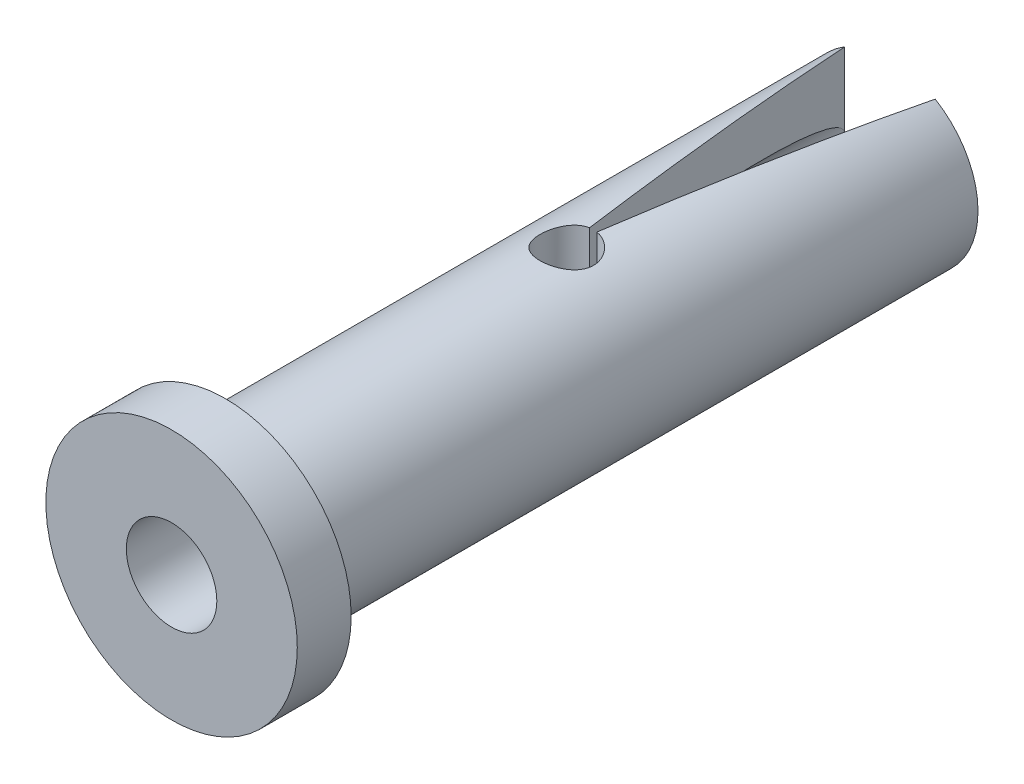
ISO-10303-21;
HEADER;
FILE_DESCRIPTION(('STEP AP214'),'2;1');
FILE_NAME('part.step','',(''),(''),'','','');
FILE_SCHEMA(('AUTOMOTIVE_DESIGN { 1 0 10303 214 1 1 1 1 }'));
ENDSEC;
DATA;
#1=APPLICATION_CONTEXT('core data for automotive mechanical design processes');
#2=APPLICATION_PROTOCOL_DEFINITION('international standard','automotive_design',2000,#1);
#3=PRODUCT_CONTEXT('',#1,'mechanical');
#4=PRODUCT('Part','Part','',(#3));
#5=PRODUCT_RELATED_PRODUCT_CATEGORY('part','',(#4));
#6=PRODUCT_DEFINITION_FORMATION('','',#4);
#7=PRODUCT_DEFINITION_CONTEXT('part definition',#1,'design');
#8=PRODUCT_DEFINITION('design','',#6,#7);
#9=PRODUCT_DEFINITION_SHAPE('','',#8);
#10=(LENGTH_UNIT() NAMED_UNIT(*) SI_UNIT(.MILLI.,.METRE.));
#11=(NAMED_UNIT(*) PLANE_ANGLE_UNIT() SI_UNIT($,.RADIAN.));
#12=(NAMED_UNIT(*) SI_UNIT($,.STERADIAN.) SOLID_ANGLE_UNIT());
#13=UNCERTAINTY_MEASURE_WITH_UNIT(LENGTH_MEASURE(1.E-05),#10,'distance_accuracy_value','');
#14=(GEOMETRIC_REPRESENTATION_CONTEXT(3) GLOBAL_UNCERTAINTY_ASSIGNED_CONTEXT((#13)) GLOBAL_UNIT_ASSIGNED_CONTEXT((#10,
#11,#12)) REPRESENTATION_CONTEXT('',''));
#15=CARTESIAN_POINT('',(0.,0.,0.));
#16=DIRECTION('',(0.,0.,1.));
#17=DIRECTION('',(1.,0.,0.));
#18=AXIS2_PLACEMENT_3D('',#15,#16,#17);
#19=CARTESIAN_POINT('',(0.,0.,20.));
#20=DIRECTION('',(0.,0.,-1.));
#21=DIRECTION('',(-1.,0.,0.));
#22=AXIS2_PLACEMENT_3D('',#19,#20,#21);
#23=CYLINDRICAL_SURFACE('',#22,1.26);
#24=CARTESIAN_POINT('',(0.,0.,8.18632314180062));
#25=DIRECTION('',(0.,0.,1.));
#26=DIRECTION('',(1.,0.,0.));
#27=AXIS2_PLACEMENT_3D('',#24,#25,#26);
#28=CIRCLE('',#27,1.26);
#29=CARTESIAN_POINT('',(-0.113914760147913,-1.25484000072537,8.18632314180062));
#30=VERTEX_POINT('',#29);
#31=CARTESIAN_POINT('',(-0.113914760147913,1.25484000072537,8.18632314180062));
#32=VERTEX_POINT('',#31);
#33=EDGE_CURVE('E236',#30,#32,#28,.F.);
#34=ORIENTED_EDGE('',*,*,#33,.F.);
#35=CARTESIAN_POINT('',(0.,0.,9.));
#36=DIRECTION('',(0.99034174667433,0.,-0.138647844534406));
#37=DIRECTION('',(-0.138647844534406,0.,-0.99034174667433));
#38=AXIS2_PLACEMENT_3D('',#35,#36,#37);
#39=ELLIPSE('',#38,9.08777200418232,1.26);
#40=CARTESIAN_POINT('',(-1.26,0.,0.));
#41=VERTEX_POINT('',#40);
#42=EDGE_CURVE('E57',#30,#41,#39,.T.);
#43=ORIENTED_EDGE('',*,*,#42,.T.);
#44=EDGE_CURVE('E228',#41,#32,#39,.T.);
#45=ORIENTED_EDGE('',*,*,#44,.T.);
#46=EDGE_LOOP('',(#34,#43,#45));
#47=FACE_BOUND('',#46,.T.);
#48=ADVANCED_FACE('F35',(#47),#23,.F.);
#49=CARTESIAN_POINT('',(0.113914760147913,1.25484000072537,8.18632314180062));
#50=VERTEX_POINT('',#49);
#51=CARTESIAN_POINT('',(0.113914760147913,-1.25484000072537,8.18632314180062));
#52=VERTEX_POINT('',#51);
#53=EDGE_CURVE('E315',#50,#52,#28,.F.);
#54=ORIENTED_EDGE('',*,*,#53,.F.);
#55=CARTESIAN_POINT('',(0.,0.,9.));
#56=DIRECTION('',(-0.99034174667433,0.,-0.138647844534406));
#57=DIRECTION('',(0.138647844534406,0.,-0.99034174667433));
#58=AXIS2_PLACEMENT_3D('',#55,#56,#57);
#59=ELLIPSE('',#58,9.08777200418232,1.26);
#60=CARTESIAN_POINT('',(1.26,0.,0.));
#61=VERTEX_POINT('',#60);
#62=EDGE_CURVE('E229',#50,#61,#59,.T.);
#63=ORIENTED_EDGE('',*,*,#62,.T.);
#64=EDGE_CURVE('E230',#61,#52,#59,.T.);
#65=ORIENTED_EDGE('',*,*,#64,.T.);
#66=EDGE_LOOP('',(#54,#63,#65));
#67=FACE_BOUND('',#66,.T.);
#68=ADVANCED_FACE('F268',(#67),#23,.F.);
#69=CARTESIAN_POINT('',(0.,0.,20.));
#70=DIRECTION('',(0.,0.,-1.));
#71=DIRECTION('',(-1.,0.,0.));
#72=AXIS2_PLACEMENT_3D('',#69,#70,#71);
#73=CYLINDRICAL_SURFACE('',#72,2.45);
#74=CARTESIAN_POINT('',(0.,0.,18.5));
#75=DIRECTION('',(0.,0.,1.));
#76=DIRECTION('',(1.,0.,0.));
#77=AXIS2_PLACEMENT_3D('',#74,#75,#76);
#78=CIRCLE('',#77,2.45);
#79=CARTESIAN_POINT('',(2.45,0.,18.5));
#80=VERTEX_POINT('',#79);
#81=EDGE_CURVE('E225',#80,#80,#78,.T.);
#82=ORIENTED_EDGE('',*,*,#81,.F.);
#83=EDGE_LOOP('',(#82));
#84=FACE_BOUND('',#83,.T.);
#85=CARTESIAN_POINT('',(0.,0.,9.));
#86=DIRECTION('',(0.99034174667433,0.,-0.138647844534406));
#87=DIRECTION('',(-0.138647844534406,0.,-0.99034174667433));
#88=AXIS2_PLACEMENT_3D('',#85,#86,#87);
#89=ELLIPSE('',#88,17.6706677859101,2.45);
#90=CARTESIAN_POINT('',(-0.103378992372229,-2.44781796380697,8.26157862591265));
#91=VERTEX_POINT('',#90);
#92=CARTESIAN_POINT('',(-1.26,-2.10116634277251,0.));
#93=VERTEX_POINT('',#92);
#94=EDGE_CURVE('E206',#91,#93,#89,.T.);
#95=ORIENTED_EDGE('',*,*,#94,.F.);
#96=CARTESIAN_POINT('',(0.,-2.45,9.74562278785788));
#97=CARTESIAN_POINT('',(-0.0408766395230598,-2.44999969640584,9.74562236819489));
#98=CARTESIAN_POINT('',(-0.0817575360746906,-2.44896726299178,9.74225024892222));
#99=CARTESIAN_POINT('',(-0.162327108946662,-2.44494964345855,9.7288840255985));
#100=CARTESIAN_POINT('',(-0.202015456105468,-2.44196392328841,9.71888811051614));
#101=CARTESIAN_POINT('',(-0.279026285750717,-2.43436654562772,9.69264021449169));
#102=CARTESIAN_POINT('',(-0.316352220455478,-2.42975732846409,9.67639761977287));
#103=CARTESIAN_POINT('',(-0.387750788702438,-2.41939094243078,9.63815641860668));
#104=CARTESIAN_POINT('',(-0.421822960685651,-2.41363361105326,9.61615699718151));
#105=CARTESIAN_POINT('',(-0.4867505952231,-2.40139441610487,9.5663439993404));
#106=CARTESIAN_POINT('',(-0.517496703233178,-2.3948973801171,9.53839162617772));
#107=CARTESIAN_POINT('',(-0.57394516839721,-2.38200063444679,9.47776190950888));
#108=CARTESIAN_POINT('',(-0.599646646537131,-2.37560094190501,9.44508374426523));
#109=CARTESIAN_POINT('',(-0.645857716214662,-2.36346217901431,9.37499744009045));
#110=CARTESIAN_POINT('',(-0.666232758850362,-2.35774191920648,9.33749702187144));
#111=CARTESIAN_POINT('',(-0.700342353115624,-2.34783694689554,9.25939981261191));
#112=CARTESIAN_POINT('',(-0.714078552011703,-2.34365185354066,9.21880379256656));
#113=CARTESIAN_POINT('',(-0.734124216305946,-2.33744938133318,9.13689780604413));
#114=CARTESIAN_POINT('',(-0.740635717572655,-2.33537317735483,9.09564186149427));
#115=CARTESIAN_POINT('',(-0.746678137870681,-2.33344867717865,9.01257487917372));
#116=CARTESIAN_POINT('',(-0.746210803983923,-2.33359982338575,8.9707639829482));
#117=CARTESIAN_POINT('',(-0.738467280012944,-2.33606088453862,8.88942653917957));
#118=CARTESIAN_POINT('',(-0.731445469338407,-2.33829014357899,8.84987292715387));
#119=CARTESIAN_POINT('',(-0.711203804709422,-2.3445255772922,8.77253411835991));
#120=CARTESIAN_POINT('',(-0.697983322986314,-2.34853193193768,8.73474910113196));
#121=CARTESIAN_POINT('',(-0.66553488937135,-2.35793363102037,8.66140342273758));
#122=CARTESIAN_POINT('',(-0.646225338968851,-2.36334765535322,8.62588135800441));
#123=CARTESIAN_POINT('',(-0.602203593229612,-2.37494583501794,8.5584970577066));
#124=CARTESIAN_POINT('',(-0.577490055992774,-2.38113018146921,8.52663573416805));
#125=CARTESIAN_POINT('',(-0.522103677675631,-2.39389808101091,8.4660361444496));
#126=CARTESIAN_POINT('',(-0.491220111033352,-2.40048735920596,8.43749134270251));
#127=CARTESIAN_POINT('',(-0.425022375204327,-2.4130871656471,8.38594031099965));
#128=CARTESIAN_POINT('',(-0.38970791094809,-2.41909765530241,8.36293445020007));
#129=CARTESIAN_POINT('',(-0.315291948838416,-2.42992031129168,8.32299224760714));
#130=CARTESIAN_POINT('',(-0.276165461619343,-2.43472371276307,8.30609992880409));
#131=CARTESIAN_POINT('',(-0.195446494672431,-2.44252778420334,8.27919320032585));
#132=CARTESIAN_POINT('',(-0.153854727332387,-2.44552897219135,8.26917681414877));
#133=CARTESIAN_POINT('',(-0.0710296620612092,-2.44930804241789,8.25663092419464));
#134=CARTESIAN_POINT('',(-0.0298395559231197,-2.45016372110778,8.25383932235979));
#135=CARTESIAN_POINT('',(0.0524238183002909,-2.44978423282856,8.25508612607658));
#136=CARTESIAN_POINT('',(0.0934971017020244,-2.44854935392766,8.25912359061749));
#137=CARTESIAN_POINT('',(0.173364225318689,-2.4441784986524,8.27370249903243));
#138=CARTESIAN_POINT('',(0.212188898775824,-2.44108759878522,8.2840898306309));
#139=CARTESIAN_POINT('',(0.287535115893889,-2.43336374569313,8.31088729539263));
#140=CARTESIAN_POINT('',(0.324056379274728,-2.42873060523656,8.32729815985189));
#141=CARTESIAN_POINT('',(0.394715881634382,-2.41826508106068,8.36611058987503));
#142=CARTESIAN_POINT('',(0.428777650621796,-2.41240700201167,8.38864425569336));
#143=CARTESIAN_POINT('',(0.492725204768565,-2.40016325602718,8.4389028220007));
#144=CARTESIAN_POINT('',(0.522609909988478,-2.39377745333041,8.46662906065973));
#145=CARTESIAN_POINT('',(0.578515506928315,-2.38089782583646,8.52771768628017));
#146=CARTESIAN_POINT('',(0.604349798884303,-2.37440891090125,8.56125225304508));
#147=CARTESIAN_POINT('',(0.650038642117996,-2.36231037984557,8.63232167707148));
#148=CARTESIAN_POINT('',(0.669893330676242,-2.35670074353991,8.66985644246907));
#149=CARTESIAN_POINT('',(0.702927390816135,-2.34705980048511,8.74775479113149));
#150=CARTESIAN_POINT('',(0.716136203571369,-2.34302155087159,8.78810497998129));
#151=CARTESIAN_POINT('',(0.735529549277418,-2.33700692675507,8.87060348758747));
#152=CARTESIAN_POINT('',(0.741716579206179,-2.33502981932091,8.91275116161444));
#153=CARTESIAN_POINT('',(0.746717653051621,-2.33343498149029,8.99570558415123));
#154=CARTESIAN_POINT('',(0.745836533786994,-2.33371969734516,9.03649231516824));
#155=CARTESIAN_POINT('',(0.737456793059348,-2.33638104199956,9.11730714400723));
#156=CARTESIAN_POINT('',(0.729958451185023,-2.33875758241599,9.15733527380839));
#157=CARTESIAN_POINT('',(0.708756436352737,-2.3452684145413,9.23498233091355));
#158=CARTESIAN_POINT('',(0.695135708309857,-2.34937916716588,9.27262602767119));
#159=CARTESIAN_POINT('',(0.662140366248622,-2.35889033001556,9.34512394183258));
#160=CARTESIAN_POINT('',(0.642764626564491,-2.36429099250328,9.37997761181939));
#161=CARTESIAN_POINT('',(0.597961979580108,-2.37602525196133,9.44731499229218));
#162=CARTESIAN_POINT('',(0.572336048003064,-2.38238616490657,9.47966151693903));
#163=CARTESIAN_POINT('',(0.516115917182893,-2.39519400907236,9.53969400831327));
#164=CARTESIAN_POINT('',(0.485520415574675,-2.40164096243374,9.56737874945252));
#165=CARTESIAN_POINT('',(0.419110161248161,-2.41412942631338,9.6181415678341));
#166=CARTESIAN_POINT('',(0.383165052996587,-2.42015266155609,9.64105408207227));
#167=CARTESIAN_POINT('',(0.307749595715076,-2.43089227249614,9.68047923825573));
#168=CARTESIAN_POINT('',(0.268280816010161,-2.43560922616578,9.69699471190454));
#169=CARTESIAN_POINT('',(0.190992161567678,-2.44282131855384,9.72177220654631));
#170=CARTESIAN_POINT('',(0.153398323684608,-2.4454906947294,9.73069141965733));
#171=CARTESIAN_POINT('',(0.0772041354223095,-2.44908002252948,9.74261638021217));
#172=CARTESIAN_POINT('',(0.0386039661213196,-2.45000028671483,9.7456231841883));
#173=CARTESIAN_POINT('',(0.,-2.45,9.74562278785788));
#174=B_SPLINE_CURVE_WITH_KNOTS('',3,(#96,#97,#98,#99,#100,#101,#102,#103,#104,#105,#106,#107,
#108,#109,#110,#111,#112,#113,#114,#115,#116,#117,#118,#119,#120,#121,#122,#123,#124,#125,#126,
#127,#128,#129,#130,#131,#132,#133,#134,#135,#136,#137,#138,#139,#140,#141,#142,#143,#144,#145,
#146,#147,#148,#149,#150,#151,#152,#153,#154,#155,#156,#157,#158,#159,#160,#161,#162,#163,#164,
#165,#166,#167,#168,#169,#170,#171,#172,#173),.UNSPECIFIED.,.T.,.F.,(4,2,2,2,2,2,2,2,2,2,2,2,2,
2,2,2,2,2,2,2,2,2,2,2,2,2,2,2,2,2,2,2,2,2,2,2,2,2,4),(0.,0.122488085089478,0.245009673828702,
0.367347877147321,0.489703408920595,0.615305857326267,0.740930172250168,0.869474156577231,
0.997986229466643,1.12280607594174,1.24759467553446,1.36773305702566,1.48788360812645,
1.60971808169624,1.73158284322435,1.85869322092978,1.985812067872,2.11382888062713,
2.24180887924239,2.36507645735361,2.48832705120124,2.60869895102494,2.72908546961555,
2.85230987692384,2.97556608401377,3.1034379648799,3.23130690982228,3.35860429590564,
3.48585640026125,3.60765083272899,3.72944011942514,3.84962696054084,3.96983732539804,
4.09453866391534,4.21927273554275,4.34779743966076,4.47626518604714,4.59196381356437,
4.707641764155),.UNSPECIFIED.);
#175=CARTESIAN_POINT('',(0.103378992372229,-2.44781796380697,8.26157862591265));
#176=VERTEX_POINT('',#175);
#177=EDGE_CURVE('E255',#176,#91,#174,.T.);
#178=ORIENTED_EDGE('',*,*,#177,.F.);
#179=CARTESIAN_POINT('',(0.,0.,9.));
#180=DIRECTION('',(-0.99034174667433,0.,-0.138647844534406));
#181=DIRECTION('',(0.138647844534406,0.,-0.99034174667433));
#182=AXIS2_PLACEMENT_3D('',#179,#180,#181);
#183=ELLIPSE('',#182,17.6706677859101,2.45);
#184=CARTESIAN_POINT('',(1.26,-2.10116634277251,0.));
#185=VERTEX_POINT('',#184);
#186=EDGE_CURVE('E211',#185,#176,#183,.T.);
#187=ORIENTED_EDGE('',*,*,#186,.F.);
#188=CARTESIAN_POINT('',(0.,0.,0.));
#189=DIRECTION('',(0.,0.,1.));
#190=DIRECTION('',(1.,0.,0.));
#191=AXIS2_PLACEMENT_3D('',#188,#189,#190);
#192=CIRCLE('',#191,2.45);
#193=CARTESIAN_POINT('',(1.26,2.10116634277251,0.));
#194=VERTEX_POINT('',#193);
#195=EDGE_CURVE('E219',#185,#194,#192,.T.);
#196=ORIENTED_EDGE('',*,*,#195,.T.);
#197=CARTESIAN_POINT('',(0.103378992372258,2.44781796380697,8.26157862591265));
#198=VERTEX_POINT('',#197);
#199=EDGE_CURVE('E209',#198,#194,#183,.T.);
#200=ORIENTED_EDGE('',*,*,#199,.F.);
#201=CARTESIAN_POINT('',(0.,2.45,8.25437721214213));
#202=CARTESIAN_POINT('',(0.0408766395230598,2.44999969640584,8.25437763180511));
#203=CARTESIAN_POINT('',(0.0817575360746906,2.44896726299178,8.25774975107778));
#204=CARTESIAN_POINT('',(0.162327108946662,2.44494964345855,8.2711159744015));
#205=CARTESIAN_POINT('',(0.202015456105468,2.44196392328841,8.28111188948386));
#206=CARTESIAN_POINT('',(0.279026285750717,2.43436654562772,8.30735978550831));
#207=CARTESIAN_POINT('',(0.316352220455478,2.42975732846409,8.32360238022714));
#208=CARTESIAN_POINT('',(0.387750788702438,2.41939094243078,8.36184358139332));
#209=CARTESIAN_POINT('',(0.421822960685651,2.41363361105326,8.38384300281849));
#210=CARTESIAN_POINT('',(0.4867505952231,2.40139441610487,8.4336560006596));
#211=CARTESIAN_POINT('',(0.517496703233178,2.3948973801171,8.46160837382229));
#212=CARTESIAN_POINT('',(0.57394516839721,2.38200063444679,8.52223809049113));
#213=CARTESIAN_POINT('',(0.599646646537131,2.37560094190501,8.55491625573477));
#214=CARTESIAN_POINT('',(0.645857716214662,2.36346217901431,8.62500255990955));
#215=CARTESIAN_POINT('',(0.666232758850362,2.35774191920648,8.66250297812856));
#216=CARTESIAN_POINT('',(0.700342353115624,2.34783694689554,8.74060018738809));
#217=CARTESIAN_POINT('',(0.714078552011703,2.34365185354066,8.78119620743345));
#218=CARTESIAN_POINT('',(0.734124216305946,2.33744938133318,8.86310219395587));
#219=CARTESIAN_POINT('',(0.740635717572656,2.33537317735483,8.90435813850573));
#220=CARTESIAN_POINT('',(0.746678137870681,2.33344867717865,8.98742512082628));
#221=CARTESIAN_POINT('',(0.746210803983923,2.33359982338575,9.02923601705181));
#222=CARTESIAN_POINT('',(0.738467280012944,2.33606088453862,9.11057346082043));
#223=CARTESIAN_POINT('',(0.731445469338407,2.33829014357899,9.15012707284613));
#224=CARTESIAN_POINT('',(0.711203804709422,2.3445255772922,9.22746588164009));
#225=CARTESIAN_POINT('',(0.697983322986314,2.34853193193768,9.26525089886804));
#226=CARTESIAN_POINT('',(0.66553488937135,2.35793363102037,9.33859657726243));
#227=CARTESIAN_POINT('',(0.646225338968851,2.36334765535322,9.37411864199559));
#228=CARTESIAN_POINT('',(0.602203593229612,2.37494583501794,9.44150294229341));
#229=CARTESIAN_POINT('',(0.577490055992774,2.38113018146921,9.47336426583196));
#230=CARTESIAN_POINT('',(0.522103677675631,2.39389808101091,9.5339638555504));
#231=CARTESIAN_POINT('',(0.491220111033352,2.40048735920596,9.56250865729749));
#232=CARTESIAN_POINT('',(0.425022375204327,2.4130871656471,9.61405968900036));
#233=CARTESIAN_POINT('',(0.38970791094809,2.41909765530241,9.63706554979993));
#234=CARTESIAN_POINT('',(0.315291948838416,2.42992031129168,9.67700775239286));
#235=CARTESIAN_POINT('',(0.276165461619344,2.43472371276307,9.69390007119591));
#236=CARTESIAN_POINT('',(0.195446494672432,2.44252778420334,9.72080679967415));
#237=CARTESIAN_POINT('',(0.153854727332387,2.44552897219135,9.73082318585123));
#238=CARTESIAN_POINT('',(0.0710296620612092,2.44930804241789,9.74336907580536));
#239=CARTESIAN_POINT('',(0.0298395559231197,2.45016372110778,9.74616067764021));
#240=CARTESIAN_POINT('',(-0.0524238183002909,2.44978423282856,9.74491387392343));
#241=CARTESIAN_POINT('',(-0.0934971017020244,2.44854935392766,9.74087640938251));
#242=CARTESIAN_POINT('',(-0.173364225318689,2.4441784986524,9.72629750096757));
#243=CARTESIAN_POINT('',(-0.212188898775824,2.44108759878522,9.7159101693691));
#244=CARTESIAN_POINT('',(-0.287535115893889,2.43336374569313,9.68911270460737));
#245=CARTESIAN_POINT('',(-0.324056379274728,2.42873060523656,9.67270184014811));
#246=CARTESIAN_POINT('',(-0.394715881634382,2.41826508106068,9.63388941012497));
#247=CARTESIAN_POINT('',(-0.428777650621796,2.41240700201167,9.61135574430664));
#248=CARTESIAN_POINT('',(-0.492725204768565,2.40016325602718,9.56109717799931));
#249=CARTESIAN_POINT('',(-0.522609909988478,2.39377745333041,9.53337093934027));
#250=CARTESIAN_POINT('',(-0.578515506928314,2.38089782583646,9.47228231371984));
#251=CARTESIAN_POINT('',(-0.604349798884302,2.37440891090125,9.43874774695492));
#252=CARTESIAN_POINT('',(-0.650038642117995,2.36231037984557,9.36767832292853));
#253=CARTESIAN_POINT('',(-0.669893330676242,2.35670074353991,9.33014355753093));
#254=CARTESIAN_POINT('',(-0.702927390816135,2.34705980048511,9.25224520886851));
#255=CARTESIAN_POINT('',(-0.716136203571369,2.34302155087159,9.21189502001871));
#256=CARTESIAN_POINT('',(-0.735529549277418,2.33700692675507,9.12939651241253));
#257=CARTESIAN_POINT('',(-0.741716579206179,2.33502981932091,9.08724883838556));
#258=CARTESIAN_POINT('',(-0.746717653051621,2.33343498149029,9.00429441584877));
#259=CARTESIAN_POINT('',(-0.745836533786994,2.33371969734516,8.96350768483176));
#260=CARTESIAN_POINT('',(-0.737456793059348,2.33638104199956,8.88269285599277));
#261=CARTESIAN_POINT('',(-0.729958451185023,2.33875758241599,8.84266472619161));
#262=CARTESIAN_POINT('',(-0.708756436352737,2.3452684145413,8.76501766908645));
#263=CARTESIAN_POINT('',(-0.695135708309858,2.34937916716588,8.72737397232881));
#264=CARTESIAN_POINT('',(-0.662140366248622,2.35889033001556,8.65487605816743));
#265=CARTESIAN_POINT('',(-0.642764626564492,2.36429099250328,8.62002238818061));
#266=CARTESIAN_POINT('',(-0.597961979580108,2.37602525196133,8.55268500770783));
#267=CARTESIAN_POINT('',(-0.572336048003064,2.38238616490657,8.52033848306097));
#268=CARTESIAN_POINT('',(-0.516115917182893,2.39519400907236,8.46030599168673));
#269=CARTESIAN_POINT('',(-0.485520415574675,2.40164096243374,8.43262125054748));
#270=CARTESIAN_POINT('',(-0.419110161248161,2.41412942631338,8.3818584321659));
#271=CARTESIAN_POINT('',(-0.383165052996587,2.42015266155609,8.35894591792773));
#272=CARTESIAN_POINT('',(-0.307749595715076,2.43089227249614,8.31952076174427));
#273=CARTESIAN_POINT('',(-0.268280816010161,2.43560922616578,8.30300528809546));
#274=CARTESIAN_POINT('',(-0.190992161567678,2.44282131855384,8.27822779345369));
#275=CARTESIAN_POINT('',(-0.153398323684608,2.4454906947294,8.26930858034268));
#276=CARTESIAN_POINT('',(-0.0772041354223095,2.44908002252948,8.25738361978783));
#277=CARTESIAN_POINT('',(-0.0386039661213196,2.45000028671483,8.2543768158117));
#278=CARTESIAN_POINT('',(0.,2.45,8.25437721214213));
#279=B_SPLINE_CURVE_WITH_KNOTS('',3,(#201,#202,#203,#204,#205,#206,#207,#208,#209,#210,#211,
#212,#213,#214,#215,#216,#217,#218,#219,#220,#221,#222,#223,#224,#225,#226,#227,#228,#229,#230,
#231,#232,#233,#234,#235,#236,#237,#238,#239,#240,#241,#242,#243,#244,#245,#246,#247,#248,#249,
#250,#251,#252,#253,#254,#255,#256,#257,#258,#259,#260,#261,#262,#263,#264,#265,#266,#267,#268,
#269,#270,#271,#272,#273,#274,#275,#276,#277,#278),.UNSPECIFIED.,.T.,.F.,(4,2,2,2,2,2,2,2,2,2,2,
2,2,2,2,2,2,2,2,2,2,2,2,2,2,2,2,2,2,2,2,2,2,2,2,2,2,2,4),(0.,0.122488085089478,
0.245009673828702,0.367347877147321,0.489703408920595,0.615305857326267,0.740930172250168,
0.869474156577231,0.997986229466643,1.12280607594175,1.24759467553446,1.36773305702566,
1.48788360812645,1.60971808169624,1.73158284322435,1.85869322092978,1.985812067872,
2.11382888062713,2.24180887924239,2.36507645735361,2.48832705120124,2.60869895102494,
2.72908546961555,2.85230987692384,2.97556608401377,3.10343796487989,3.23130690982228,
3.35860429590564,3.48585640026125,3.60765083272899,3.72944011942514,3.84962696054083,
3.96983732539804,4.09453866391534,4.21927273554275,4.34779743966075,4.47626518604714,
4.59196381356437,4.707641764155),.UNSPECIFIED.);
#280=CARTESIAN_POINT('',(-0.103378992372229,2.44781796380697,8.26157862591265));
#281=VERTEX_POINT('',#280);
#282=EDGE_CURVE('E190',#198,#281,#279,.T.);
#283=ORIENTED_EDGE('',*,*,#282,.T.);
#284=CARTESIAN_POINT('',(-1.26,2.10116634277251,0.));
#285=VERTEX_POINT('',#284);
#286=EDGE_CURVE('E208',#285,#281,#89,.T.);
#287=ORIENTED_EDGE('',*,*,#286,.F.);
#288=EDGE_CURVE('E224',#285,#93,#192,.T.);
#289=ORIENTED_EDGE('',*,*,#288,.T.);
#290=EDGE_LOOP('',(#95,#178,#187,#196,#200,#283,#287,#289));
#291=FACE_BOUND('',#290,.T.);
#292=ADVANCED_FACE('F251',(#84,#291),#73,.T.);
#293=CARTESIAN_POINT('',(0.,0.,9.98562278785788));
#294=DIRECTION('',(0.,0.,1.));
#295=DIRECTION('',(1.,0.,0.));
#296=AXIS2_PLACEMENT_3D('',#293,#294,#295);
#297=CIRCLE('',#296,1.26);
#298=CARTESIAN_POINT('',(1.26,0.,9.98562278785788));
#299=VERTEX_POINT('',#298);
#300=EDGE_CURVE('E11',#299,#299,#297,.F.);
#301=ORIENTED_EDGE('',*,*,#300,.T.);
#302=EDGE_LOOP('',(#301));
#303=FACE_BOUND('',#302,.T.);
#304=CARTESIAN_POINT('',(0.,0.,20.));
#305=DIRECTION('',(0.,0.,1.));
#306=DIRECTION('',(1.,0.,0.));
#307=AXIS2_PLACEMENT_3D('',#304,#305,#306);
#308=CIRCLE('',#307,1.26);
#309=CARTESIAN_POINT('',(1.26,0.,20.));
#310=VERTEX_POINT('',#309);
#311=EDGE_CURVE('E212',#310,#310,#308,.T.);
#312=ORIENTED_EDGE('',*,*,#311,.T.);
#313=EDGE_LOOP('',(#312));
#314=FACE_BOUND('',#313,.T.);
#315=ADVANCED_FACE('F269',(#303,#314),#23,.F.);
#316=CARTESIAN_POINT('',(1.26,3.5,0.));
#317=DIRECTION('',(-0.99034174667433,0.,-0.138647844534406));
#318=DIRECTION('',(-0.138647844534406,0.,0.99034174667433));
#319=AXIS2_PLACEMENT_3D('',#316,#317,#318);
#320=PLANE('',#319);
#321=CARTESIAN_POINT('',(0.103350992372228,1.26740684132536,8.26177862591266));
#322=CARTESIAN_POINT('',(0.128499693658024,1.23757913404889,8.08214504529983));
#323=CARTESIAN_POINT('',(0.15363115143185,1.20694672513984,7.90263463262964));
#324=CARTESIAN_POINT('',(0.203849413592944,1.14348617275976,7.5439327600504));
#325=CARTESIAN_POINT('',(0.228936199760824,1.11065728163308,7.36474143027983));
#326=CARTESIAN_POINT('',(0.279088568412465,1.042167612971,7.00651022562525));
#327=CARTESIAN_POINT('',(0.304154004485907,1.00650122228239,6.82747139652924));
#328=CARTESIAN_POINT('',(0.354175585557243,0.931442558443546,6.47017438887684));
#329=CARTESIAN_POINT('',(0.379131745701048,0.89205081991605,6.29191610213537));
#330=CARTESIAN_POINT('',(0.419229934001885,0.824170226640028,6.00550047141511));
#331=CARTESIAN_POINT('',(0.434426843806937,0.797373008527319,5.89695111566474));
#332=CARTESIAN_POINT('',(0.464721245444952,0.741100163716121,5.68056253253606));
#333=CARTESIAN_POINT('',(0.479818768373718,0.71162542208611,5.57272308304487));
#334=CARTESIAN_POINT('',(0.50503475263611,0.65899571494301,5.39260890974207));
#335=CARTESIAN_POINT('',(0.515193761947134,0.636854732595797,5.32004455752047));
#336=CARTESIAN_POINT('',(0.53541049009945,0.590294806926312,5.1756393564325));
#337=CARTESIAN_POINT('',(0.545468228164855,0.565876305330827,5.10379837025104));
#338=CARTESIAN_POINT('',(0.562273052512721,0.522073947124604,4.98376391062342));
#339=CARTESIAN_POINT('',(0.569062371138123,0.503536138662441,4.93526877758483));
#340=CARTESIAN_POINT('',(0.582527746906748,0.464517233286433,4.83908752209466));
#341=CARTESIAN_POINT('',(0.58920389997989,0.444037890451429,4.79140071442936));
#342=CARTESIAN_POINT('',(0.60035287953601,0.407102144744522,4.71176514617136));
#343=CARTESIAN_POINT('',(0.604870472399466,0.391351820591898,4.6794966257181));
#344=CARTESIAN_POINT('',(0.613796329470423,0.358109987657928,4.61574050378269));
#345=CARTESIAN_POINT('',(0.618204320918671,0.340614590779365,4.58425485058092));
#346=CARTESIAN_POINT('',(0.627109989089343,0.302088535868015,4.52064293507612));
#347=CARTESIAN_POINT('',(0.631594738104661,0.280901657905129,4.48860901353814));
#348=CARTESIAN_POINT('',(0.640169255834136,0.23468980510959,4.4273624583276));
#349=CARTESIAN_POINT('',(0.64426069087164,0.209682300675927,4.39813792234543));
#350=CARTESIAN_POINT('',(0.649394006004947,0.170438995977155,4.36147138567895));
#351=CARTESIAN_POINT('',(0.650797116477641,0.158697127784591,4.35144916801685));
#352=CARTESIAN_POINT('',(0.653398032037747,0.13405968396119,4.33287119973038));
#353=CARTESIAN_POINT('',(0.654595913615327,0.121164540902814,4.32431490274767));
#354=CARTESIAN_POINT('',(0.656514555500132,0.0964587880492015,4.3106103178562));
#355=CARTESIAN_POINT('',(0.657281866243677,0.0848392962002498,4.30512952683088));
#356=CARTESIAN_POINT('',(0.658541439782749,0.0608615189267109,4.29613257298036));
#357=CARTESIAN_POINT('',(0.659034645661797,0.0485059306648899,4.29260967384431));
#358=CARTESIAN_POINT('',(0.659515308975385,0.0299861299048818,4.28917636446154));
#359=CARTESIAN_POINT('',(0.659632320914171,0.0239892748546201,4.28834056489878));
#360=CARTESIAN_POINT('',(0.659788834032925,0.0119296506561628,4.28722261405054));
#361=CARTESIAN_POINT('',(0.659828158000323,0.00586676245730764,4.28694172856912));
#362=CARTESIAN_POINT('',(0.659826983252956,-0.000199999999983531,4.28695011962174));
#363=B_SPLINE_CURVE_WITH_KNOTS('',3,(#321,#322,#323,#324,#325,#326,#327,#328,#329,#330,#331,
#332,#333,#334,#335,#336,#337,#338,#339,#340,#341,#342,#343,#344,#345,#346,#347,#348,#349,#350,
#351,#352,#353,#354,#355,#356,#357,#358,#359,#360,#361,#362),.UNSPECIFIED.,.F.,.F.,(4,2,2,2,2,2,
2,2,2,2,2,2,2,2,2,2,2,2,2,2,4),(0.,0.551475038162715,1.1031387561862,1.65592229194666,
2.20862661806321,2.54711329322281,2.88548848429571,3.11509706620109,3.34466120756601,
3.50171262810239,3.65862348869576,3.76716215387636,3.87594829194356,3.99183549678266,
4.10720782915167,4.15363197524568,4.20003878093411,4.23851691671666,4.27686183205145,
4.29500623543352,4.31319198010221),.UNSPECIFIED.);
#364=CARTESIAN_POINT('',(0.10337899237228,1.26737367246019,8.26157862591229));
#365=VERTEX_POINT('',#364);
#366=EDGE_CURVE('E124',#365,#50,#363,.T.);
#367=ORIENTED_EDGE('',*,*,#366,.F.);
#368=DIRECTION('',(0.,-1.,0.));
#369=VECTOR('',#368,1.);
#370=CARTESIAN_POINT('',(0.103378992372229,3.501,8.26157862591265));
#371=LINE('',#370,#369);
#372=EDGE_CURVE('E136',#198,#365,#371,.T.);
#373=ORIENTED_EDGE('',*,*,#372,.F.);
#374=ORIENTED_EDGE('',*,*,#199,.T.);
#375=DIRECTION('',(0.,-1.,0.));
#376=VECTOR('',#375,1.);
#377=CARTESIAN_POINT('',(1.26,3.5,0.));
#378=LINE('',#377,#376);
#379=EDGE_CURVE('E205',#194,#61,#378,.T.);
#380=ORIENTED_EDGE('',*,*,#379,.T.);
#381=ORIENTED_EDGE('',*,*,#62,.F.);
#382=EDGE_LOOP('',(#367,#373,#374,#380,#381));
#383=FACE_BOUND('',#382,.T.);
#384=ADVANCED_FACE('F275',(#383),#320,.T.);
#385=CARTESIAN_POINT('',(0.,3.5,9.));
#386=DIRECTION('',(0.99034174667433,0.,-0.138647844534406));
#387=DIRECTION('',(-0.138647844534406,0.,-0.99034174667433));
#388=AXIS2_PLACEMENT_3D('',#385,#386,#387);
#389=PLANE('',#388);
#390=CARTESIAN_POINT('',(-0.659826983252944,-0.0002,4.28695011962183));
#391=CARTESIAN_POINT('',(-0.659835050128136,0.0125632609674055,4.28689249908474));
#392=CARTESIAN_POINT('',(-0.659654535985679,0.0252608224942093,4.28818188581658));
#393=CARTESIAN_POINT('',(-0.658976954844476,0.0500123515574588,4.29302175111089));
#394=CARTESIAN_POINT('',(-0.658484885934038,0.062073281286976,4.29653652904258));
#395=CARTESIAN_POINT('',(-0.657061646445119,0.0888422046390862,4.30670252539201));
#396=CARTESIAN_POINT('',(-0.656044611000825,0.103306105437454,4.31396706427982));
#397=CARTESIAN_POINT('',(-0.653707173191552,0.130976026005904,4.33066304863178));
#398=CARTESIAN_POINT('',(-0.652384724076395,0.144172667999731,4.34010911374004));
#399=CARTESIAN_POINT('',(-0.648290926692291,0.18041900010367,4.3693505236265));
#400=CARTESIAN_POINT('',(-0.645266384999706,0.201954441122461,4.39095439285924));
#401=CARTESIAN_POINT('',(-0.638864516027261,0.241999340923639,4.43668202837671));
#402=CARTESIAN_POINT('',(-0.635486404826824,0.260501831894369,4.46081139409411));
#403=CARTESIAN_POINT('',(-0.62884866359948,0.293719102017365,4.50822383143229));
#404=CARTESIAN_POINT('',(-0.625607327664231,0.308626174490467,4.53137623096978));
#405=CARTESIAN_POINT('',(-0.61901133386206,0.337084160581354,4.57849047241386));
#406=CARTESIAN_POINT('',(-0.615656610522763,0.350634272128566,4.60245278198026));
#407=CARTESIAN_POINT('',(-0.605462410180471,0.3897558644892,4.67526849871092));
#408=CARTESIAN_POINT('',(-0.598506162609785,0.413736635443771,4.72495598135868));
#409=CARTESIAN_POINT('',(-0.584386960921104,0.459010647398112,4.82580742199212));
#410=CARTESIAN_POINT('',(-0.57722307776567,0.480288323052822,4.8769780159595));
#411=CARTESIAN_POINT('',(-0.562795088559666,0.520754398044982,4.98003508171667));
#412=CARTESIAN_POINT('',(-0.55553113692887,0.539945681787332,5.03192045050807));
#413=CARTESIAN_POINT('',(-0.533817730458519,0.594734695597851,5.18701621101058));
#414=CARTESIAN_POINT('',(-0.519261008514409,0.628105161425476,5.29099279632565));
#415=CARTESIAN_POINT('',(-0.489987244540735,0.691003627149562,5.50009111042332));
#416=CARTESIAN_POINT('',(-0.475270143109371,0.720530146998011,5.60521326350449));
#417=CARTESIAN_POINT('',(-0.445712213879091,0.776862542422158,5.81634132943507));
#418=CARTESIAN_POINT('',(-0.430871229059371,0.803664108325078,5.92234836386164));
#419=CARTESIAN_POINT('',(-0.401122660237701,0.855167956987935,6.13483814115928));
#420=CARTESIAN_POINT('',(-0.386215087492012,0.879870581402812,6.24132080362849));
#421=CARTESIAN_POINT('',(-0.341496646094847,0.951405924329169,6.56073824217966));
#422=CARTESIAN_POINT('',(-0.311611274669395,0.995810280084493,6.77420518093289));
#423=CARTESIAN_POINT('',(-0.25174452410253,1.08023538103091,7.20182482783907));
#424=CARTESIAN_POINT('',(-0.221763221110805,1.12025899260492,7.41597699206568));
#425=CARTESIAN_POINT('',(-0.177026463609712,1.17751176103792,7.73552525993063));
#426=CARTESIAN_POINT('',(-0.162300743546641,1.19595972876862,7.84070897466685));
#427=CARTESIAN_POINT('',(-0.132835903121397,1.23217218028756,8.05117212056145));
#428=CARTESIAN_POINT('',(-0.11809678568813,1.2499367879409,8.15645153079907));
#429=CARTESIAN_POINT('',(-0.103350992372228,1.26740684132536,8.26177862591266));
#430=B_SPLINE_CURVE_WITH_KNOTS('',3,(#390,#391,#392,#393,#394,#395,#396,#397,#398,#399,#400,
#401,#402,#403,#404,#405,#406,#407,#408,#409,#410,#411,#412,#413,#414,#415,#416,#417,#418,#419,
#420,#421,#422,#423,#424,#425,#426,#427,#428,#429),.UNSPECIFIED.,.F.,.F.,(4,2,2,2,2,2,2,2,2,2,2,
2,2,2,2,2,2,2,2,4),(0.,0.0381148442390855,0.0756332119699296,0.124009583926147,
0.172720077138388,0.264169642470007,0.355826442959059,0.438942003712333,0.522106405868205,
0.688775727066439,0.856365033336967,1.02371962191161,1.35408422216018,1.68457564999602,
2.01558189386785,2.34653415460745,3.00668091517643,3.66639311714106,3.9897904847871,
4.31312895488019),.UNSPECIFIED.);
#431=CARTESIAN_POINT('',(-0.103378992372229,1.26737367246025,8.26157862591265));
#432=VERTEX_POINT('',#431);
#433=EDGE_CURVE('E119',#32,#432,#430,.T.);
#434=ORIENTED_EDGE('',*,*,#433,.F.);
#435=ORIENTED_EDGE('',*,*,#44,.F.);
#436=DIRECTION('',(0.,-1.,0.));
#437=VECTOR('',#436,1.);
#438=CARTESIAN_POINT('',(-1.26,3.5,0.));
#439=LINE('',#438,#437);
#440=EDGE_CURVE('E202',#285,#41,#439,.T.);
#441=ORIENTED_EDGE('',*,*,#440,.F.);
#442=ORIENTED_EDGE('',*,*,#286,.T.);
#443=DIRECTION('',(0.,-1.,0.));
#444=VECTOR('',#443,1.);
#445=CARTESIAN_POINT('',(-0.103378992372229,3.501,8.26157862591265));
#446=LINE('',#445,#444);
#447=EDGE_CURVE('E196',#432,#281,#446,.F.);
#448=ORIENTED_EDGE('',*,*,#447,.F.);
#449=EDGE_LOOP('',(#434,#435,#441,#442,#448));
#450=FACE_BOUND('',#449,.T.);
#451=ADVANCED_FACE('F186',(#450),#389,.T.);
#452=CARTESIAN_POINT('',(0.,0.,0.));
#453=DIRECTION('',(0.,0.,1.));
#454=DIRECTION('',(1.,0.,0.));
#455=AXIS2_PLACEMENT_3D('',#452,#453,#454);
#456=PLANE('',#455);
#457=ORIENTED_EDGE('',*,*,#379,.F.);
#458=ORIENTED_EDGE('',*,*,#195,.F.);
#459=EDGE_CURVE('E203',#61,#185,#378,.T.);
#460=ORIENTED_EDGE('',*,*,#459,.F.);
#461=EDGE_LOOP('',(#457,#458,#460));
#462=FACE_BOUND('',#461,.T.);
#463=ADVANCED_FACE('F298',(#462),#456,.F.);
#464=EDGE_CURVE('E199',#41,#93,#439,.T.);
#465=ORIENTED_EDGE('',*,*,#464,.T.);
#466=ORIENTED_EDGE('',*,*,#288,.F.);
#467=ORIENTED_EDGE('',*,*,#440,.T.);
#468=EDGE_LOOP('',(#465,#466,#467));
#469=FACE_BOUND('',#468,.T.);
#470=ADVANCED_FACE('F249',(#469),#456,.F.);
#471=CARTESIAN_POINT('',(0.,0.,20.));
#472=DIRECTION('',(0.,0.,1.));
#473=DIRECTION('',(1.,0.,0.));
#474=AXIS2_PLACEMENT_3D('',#471,#472,#473);
#475=PLANE('',#474);
#476=CARTESIAN_POINT('',(0.,0.,20.));
#477=DIRECTION('',(0.,0.,1.));
#478=DIRECTION('',(1.,0.,0.));
#479=AXIS2_PLACEMENT_3D('',#476,#477,#478);
#480=CIRCLE('',#479,3.5);
#481=CARTESIAN_POINT('',(3.5,0.,20.));
#482=VERTEX_POINT('',#481);
#483=EDGE_CURVE('E215',#482,#482,#480,.T.);
#484=ORIENTED_EDGE('',*,*,#483,.T.);
#485=EDGE_LOOP('',(#484));
#486=FACE_BOUND('',#485,.T.);
#487=ORIENTED_EDGE('',*,*,#311,.F.);
#488=EDGE_LOOP('',(#487));
#489=FACE_BOUND('',#488,.T.);
#490=ADVANCED_FACE('F287',(#486,#489),#475,.T.);
#491=CARTESIAN_POINT('',(0.,0.,18.5));
#492=DIRECTION('',(0.,0.,1.));
#493=DIRECTION('',(1.,0.,0.));
#494=AXIS2_PLACEMENT_3D('',#491,#492,#493);
#495=PLANE('',#494);
#496=CARTESIAN_POINT('',(0.,0.,18.5));
#497=DIRECTION('',(0.,0.,1.));
#498=DIRECTION('',(1.,0.,0.));
#499=AXIS2_PLACEMENT_3D('',#496,#497,#498);
#500=CIRCLE('',#499,3.5);
#501=CARTESIAN_POINT('',(3.5,0.,18.5));
#502=VERTEX_POINT('',#501);
#503=EDGE_CURVE('E216',#502,#502,#500,.T.);
#504=ORIENTED_EDGE('',*,*,#503,.F.);
#505=EDGE_LOOP('',(#504));
#506=FACE_BOUND('',#505,.T.);
#507=ORIENTED_EDGE('',*,*,#81,.T.);
#508=EDGE_LOOP('',(#507));
#509=FACE_BOUND('',#508,.T.);
#510=ADVANCED_FACE('F289',(#506,#509),#495,.F.);
#511=CARTESIAN_POINT('',(0.,0.,18.5));
#512=DIRECTION('',(0.,0.,1.));
#513=DIRECTION('',(1.,0.,0.));
#514=AXIS2_PLACEMENT_3D('',#511,#512,#513);
#515=CYLINDRICAL_SURFACE('',#514,3.5);
#516=ORIENTED_EDGE('',*,*,#503,.T.);
#517=EDGE_LOOP('',(#516));
#518=FACE_BOUND('',#517,.T.);
#519=ORIENTED_EDGE('',*,*,#483,.F.);
#520=EDGE_LOOP('',(#519));
#521=FACE_BOUND('',#520,.T.);
#522=ADVANCED_FACE('F296',(#518,#521),#515,.T.);
#523=CARTESIAN_POINT('',(-0.103350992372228,-1.26740684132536,8.26177862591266));
#524=CARTESIAN_POINT('',(-0.128499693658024,-1.23757913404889,8.08214504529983));
#525=CARTESIAN_POINT('',(-0.15363115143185,-1.20694672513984,7.90263463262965));
#526=CARTESIAN_POINT('',(-0.203849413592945,-1.14348617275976,7.5439327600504));
#527=CARTESIAN_POINT('',(-0.228936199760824,-1.11065728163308,7.36474143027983));
#528=CARTESIAN_POINT('',(-0.279088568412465,-1.042167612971,7.00651022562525));
#529=CARTESIAN_POINT('',(-0.304154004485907,-1.00650122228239,6.82747139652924));
#530=CARTESIAN_POINT('',(-0.354175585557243,-0.931442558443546,6.47017438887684));
#531=CARTESIAN_POINT('',(-0.379131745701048,-0.89205081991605,6.29191610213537));
#532=CARTESIAN_POINT('',(-0.419229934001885,-0.824170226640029,6.00550047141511));
#533=CARTESIAN_POINT('',(-0.434426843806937,-0.79737300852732,5.89695111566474));
#534=CARTESIAN_POINT('',(-0.464721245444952,-0.741100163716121,5.68056253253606));
#535=CARTESIAN_POINT('',(-0.479818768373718,-0.711625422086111,5.57272308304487));
#536=CARTESIAN_POINT('',(-0.50503475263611,-0.658995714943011,5.39260890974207));
#537=CARTESIAN_POINT('',(-0.515193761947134,-0.636854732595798,5.32004455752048));
#538=CARTESIAN_POINT('',(-0.535410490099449,-0.590294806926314,5.17563935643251));
#539=CARTESIAN_POINT('',(-0.545468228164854,-0.565876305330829,5.10379837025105));
#540=CARTESIAN_POINT('',(-0.56227305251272,-0.522073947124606,4.98376391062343));
#541=CARTESIAN_POINT('',(-0.569062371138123,-0.503536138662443,4.93526877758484));
#542=CARTESIAN_POINT('',(-0.582527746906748,-0.464517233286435,4.83908752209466));
#543=CARTESIAN_POINT('',(-0.589203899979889,-0.44403789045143,4.79140071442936));
#544=CARTESIAN_POINT('',(-0.600352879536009,-0.407102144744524,4.71176514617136));
#545=CARTESIAN_POINT('',(-0.604870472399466,-0.3913518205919,4.6794966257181));
#546=CARTESIAN_POINT('',(-0.613796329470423,-0.35810998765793,4.6157405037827));
#547=CARTESIAN_POINT('',(-0.618204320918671,-0.340614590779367,4.58425485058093));
#548=CARTESIAN_POINT('',(-0.627109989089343,-0.302088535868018,4.52064293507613));
#549=CARTESIAN_POINT('',(-0.631594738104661,-0.280901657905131,4.48860901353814));
#550=CARTESIAN_POINT('',(-0.640169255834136,-0.234689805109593,4.4273624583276));
#551=CARTESIAN_POINT('',(-0.64426069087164,-0.20968230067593,4.39813792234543));
#552=CARTESIAN_POINT('',(-0.649394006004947,-0.170438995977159,4.36147138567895));
#553=CARTESIAN_POINT('',(-0.65079711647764,-0.158697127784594,4.35144916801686));
#554=CARTESIAN_POINT('',(-0.653398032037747,-0.134059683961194,4.33287119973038));
#555=CARTESIAN_POINT('',(-0.654595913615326,-0.121164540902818,4.32431490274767));
#556=CARTESIAN_POINT('',(-0.656514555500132,-0.0964587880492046,4.3106103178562));
#557=CARTESIAN_POINT('',(-0.657281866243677,-0.0848392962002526,4.30512952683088));
#558=CARTESIAN_POINT('',(-0.658541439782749,-0.0608615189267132,4.29613257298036));
#559=CARTESIAN_POINT('',(-0.659034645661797,-0.0485059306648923,4.29260967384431));
#560=CARTESIAN_POINT('',(-0.659515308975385,-0.0299861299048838,4.28917636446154));
#561=CARTESIAN_POINT('',(-0.659632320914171,-0.0239892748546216,4.28834056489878));
#562=CARTESIAN_POINT('',(-0.659788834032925,-0.0119296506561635,4.28722261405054));
#563=CARTESIAN_POINT('',(-0.659828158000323,-0.00586676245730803,4.28694172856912));
#564=CARTESIAN_POINT('',(-0.659826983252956,0.000199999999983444,4.28695011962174));
#565=B_SPLINE_CURVE_WITH_KNOTS('',3,(#523,#524,#525,#526,#527,#528,#529,#530,#531,#532,#533,
#534,#535,#536,#537,#538,#539,#540,#541,#542,#543,#544,#545,#546,#547,#548,#549,#550,#551,#552,
#553,#554,#555,#556,#557,#558,#559,#560,#561,#562,#563,#564),.UNSPECIFIED.,.F.,.F.,(4,2,2,2,2,2,
2,2,2,2,2,2,2,2,2,2,2,2,2,2,4),(0.,0.551475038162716,1.1031387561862,1.65592229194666,
2.20862661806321,2.54711329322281,2.88548848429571,3.11509706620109,3.34466120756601,
3.50171262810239,3.65862348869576,3.76716215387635,3.87594829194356,3.99183549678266,
4.10720782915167,4.15363197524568,4.2000387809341,4.23851691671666,4.27686183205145,
4.29500623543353,4.31319198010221),.UNSPECIFIED.);
#566=CARTESIAN_POINT('',(-0.103378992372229,-1.26737367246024,8.26157862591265));
#567=VERTEX_POINT('',#566);
#568=EDGE_CURVE('E145',#567,#30,#565,.T.);
#569=ORIENTED_EDGE('',*,*,#568,.F.);
#570=DIRECTION('',(0.,1.,0.));
#571=VECTOR('',#570,1.);
#572=CARTESIAN_POINT('',(-0.103378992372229,-3.501,8.26157862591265));
#573=LINE('',#572,#571);
#574=EDGE_CURVE('E254',#567,#91,#573,.F.);
#575=ORIENTED_EDGE('',*,*,#574,.T.);
#576=ORIENTED_EDGE('',*,*,#94,.T.);
#577=ORIENTED_EDGE('',*,*,#464,.F.);
#578=ORIENTED_EDGE('',*,*,#42,.F.);
#579=EDGE_LOOP('',(#569,#575,#576,#577,#578));
#580=FACE_BOUND('',#579,.T.);
#581=ADVANCED_FACE('F244',(#580),#389,.T.);
#582=CARTESIAN_POINT('',(0.659826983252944,0.0002,4.28695011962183));
#583=CARTESIAN_POINT('',(0.659835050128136,-0.0125632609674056,4.28689249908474));
#584=CARTESIAN_POINT('',(0.659654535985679,-0.0252608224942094,4.28818188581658));
#585=CARTESIAN_POINT('',(0.658976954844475,-0.0500123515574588,4.29302175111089));
#586=CARTESIAN_POINT('',(0.658484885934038,-0.062073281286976,4.29653652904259));
#587=CARTESIAN_POINT('',(0.657061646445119,-0.0888422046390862,4.30670252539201));
#588=CARTESIAN_POINT('',(0.656044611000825,-0.103306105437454,4.31396706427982));
#589=CARTESIAN_POINT('',(0.653707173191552,-0.130976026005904,4.33066304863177));
#590=CARTESIAN_POINT('',(0.652384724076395,-0.144172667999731,4.34010911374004));
#591=CARTESIAN_POINT('',(0.648290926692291,-0.18041900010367,4.3693505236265));
#592=CARTESIAN_POINT('',(0.645266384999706,-0.201954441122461,4.39095439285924));
#593=CARTESIAN_POINT('',(0.638864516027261,-0.241999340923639,4.43668202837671));
#594=CARTESIAN_POINT('',(0.635486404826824,-0.26050183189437,4.46081139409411));
#595=CARTESIAN_POINT('',(0.62884866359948,-0.293719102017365,4.50822383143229));
#596=CARTESIAN_POINT('',(0.625607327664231,-0.308626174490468,4.53137623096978));
#597=CARTESIAN_POINT('',(0.61901133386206,-0.337084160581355,4.57849047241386));
#598=CARTESIAN_POINT('',(0.615656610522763,-0.350634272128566,4.60245278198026));
#599=CARTESIAN_POINT('',(0.605462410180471,-0.3897558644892,4.67526849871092));
#600=CARTESIAN_POINT('',(0.598506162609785,-0.413736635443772,4.72495598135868));
#601=CARTESIAN_POINT('',(0.584386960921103,-0.459010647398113,4.82580742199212));
#602=CARTESIAN_POINT('',(0.57722307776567,-0.480288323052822,4.8769780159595));
#603=CARTESIAN_POINT('',(0.562795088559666,-0.520754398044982,4.98003508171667));
#604=CARTESIAN_POINT('',(0.55553113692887,-0.539945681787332,5.03192045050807));
#605=CARTESIAN_POINT('',(0.533817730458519,-0.594734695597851,5.18701621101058));
#606=CARTESIAN_POINT('',(0.519261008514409,-0.628105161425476,5.29099279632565));
#607=CARTESIAN_POINT('',(0.489987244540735,-0.691003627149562,5.50009111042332));
#608=CARTESIAN_POINT('',(0.475270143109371,-0.720530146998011,5.60521326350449));
#609=CARTESIAN_POINT('',(0.445712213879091,-0.776862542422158,5.81634132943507));
#610=CARTESIAN_POINT('',(0.430871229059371,-0.803664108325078,5.92234836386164));
#611=CARTESIAN_POINT('',(0.401122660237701,-0.855167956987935,6.13483814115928));
#612=CARTESIAN_POINT('',(0.386215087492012,-0.879870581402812,6.24132080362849));
#613=CARTESIAN_POINT('',(0.341496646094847,-0.951405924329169,6.56073824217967));
#614=CARTESIAN_POINT('',(0.311611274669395,-0.995810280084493,6.77420518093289));
#615=CARTESIAN_POINT('',(0.25174452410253,-1.08023538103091,7.20182482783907));
#616=CARTESIAN_POINT('',(0.221763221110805,-1.12025899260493,7.41597699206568));
#617=CARTESIAN_POINT('',(0.177026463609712,-1.17751176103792,7.73552525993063));
#618=CARTESIAN_POINT('',(0.162300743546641,-1.19595972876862,7.84070897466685));
#619=CARTESIAN_POINT('',(0.132835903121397,-1.23217218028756,8.05117212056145));
#620=CARTESIAN_POINT('',(0.11809678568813,-1.2499367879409,8.15645153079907));
#621=CARTESIAN_POINT('',(0.103350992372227,-1.26740684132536,8.26177862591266));
#622=B_SPLINE_CURVE_WITH_KNOTS('',3,(#582,#583,#584,#585,#586,#587,#588,#589,#590,#591,#592,
#593,#594,#595,#596,#597,#598,#599,#600,#601,#602,#603,#604,#605,#606,#607,#608,#609,#610,#611,
#612,#613,#614,#615,#616,#617,#618,#619,#620,#621),.UNSPECIFIED.,.F.,.F.,(4,2,2,2,2,2,2,2,2,2,2,
2,2,2,2,2,2,2,2,4),(0.,0.0381148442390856,0.0756332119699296,0.124009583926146,
0.172720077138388,0.264169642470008,0.355826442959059,0.438942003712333,0.522106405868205,
0.68877572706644,0.856365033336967,1.02371962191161,1.35408422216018,1.68457564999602,
2.01558189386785,2.34653415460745,3.00668091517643,3.66639311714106,3.98979048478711,
4.3131289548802),.UNSPECIFIED.);
#623=CARTESIAN_POINT('',(0.103378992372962,-1.26737367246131,8.26157862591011));
#624=VERTEX_POINT('',#623);
#625=EDGE_CURVE('E131',#52,#624,#622,.T.);
#626=ORIENTED_EDGE('',*,*,#625,.F.);
#627=ORIENTED_EDGE('',*,*,#64,.F.);
#628=ORIENTED_EDGE('',*,*,#459,.T.);
#629=ORIENTED_EDGE('',*,*,#186,.T.);
#630=DIRECTION('',(0.,1.,0.));
#631=VECTOR('',#630,1.);
#632=CARTESIAN_POINT('',(0.103378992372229,-3.501,8.26157862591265));
#633=LINE('',#632,#631);
#634=EDGE_CURVE('E137',#176,#624,#633,.T.);
#635=ORIENTED_EDGE('',*,*,#634,.T.);
#636=EDGE_LOOP('',(#626,#627,#628,#629,#635));
#637=FACE_BOUND('',#636,.T.);
#638=ADVANCED_FACE('F151',(#637),#320,.T.);
#639=CARTESIAN_POINT('',(0.,3.501,9.));
#640=DIRECTION('',(0.,-1.,0.));
#641=DIRECTION('',(0.,0.,-1.));
#642=AXIS2_PLACEMENT_3D('',#639,#640,#641);
#643=CYLINDRICAL_SURFACE('',#642,0.745622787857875);
#644=CARTESIAN_POINT('',(-0.521798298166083,1.19424116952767,8.46738393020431));
#645=CARTESIAN_POINT('',(-0.549577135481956,1.18667402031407,8.49460043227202));
#646=CARTESIAN_POINT('',(-0.575301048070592,1.17936008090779,8.52406736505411));
#647=CARTESIAN_POINT('',(-0.622008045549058,1.16639288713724,8.58696451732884));
#648=CARTESIAN_POINT('',(-0.642980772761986,1.16074325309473,8.62040315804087));
#649=CARTESIAN_POINT('',(-0.679587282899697,1.15227222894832,8.69066497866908));
#650=CARTESIAN_POINT('',(-0.695194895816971,1.14946457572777,8.72750366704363));
#651=CARTESIAN_POINT('',(-0.720301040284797,1.14769302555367,8.80325797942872));
#652=CARTESIAN_POINT('',(-0.729809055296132,1.1487231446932,8.84217027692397));
#653=CARTESIAN_POINT('',(-0.741908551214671,1.15470565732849,8.91726342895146));
#654=CARTESIAN_POINT('',(-0.745028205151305,1.15931026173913,8.95338861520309));
#655=CARTESIAN_POINT('',(-0.746062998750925,1.17175991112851,9.02515468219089));
#656=CARTESIAN_POINT('',(-0.743975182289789,1.17960679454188,9.06079527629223));
#657=CARTESIAN_POINT('',(-0.73489784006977,1.19795943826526,9.13090238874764));
#658=CARTESIAN_POINT('',(-0.727884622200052,1.20847789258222,9.1653623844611));
#659=CARTESIAN_POINT('',(-0.709339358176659,1.23137358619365,9.2323820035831));
#660=CARTESIAN_POINT('',(-0.697805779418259,1.24375145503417,9.2649409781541));
#661=CARTESIAN_POINT('',(-0.668284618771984,1.27176686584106,9.3330921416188));
#662=CARTESIAN_POINT('',(-0.649538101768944,1.28760261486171,9.3682743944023));
#663=CARTESIAN_POINT('',(-0.606780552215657,1.31963084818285,9.43514132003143));
#664=CARTESIAN_POINT('',(-0.582763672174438,1.33582371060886,9.46682204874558));
#665=CARTESIAN_POINT('',(-0.526325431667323,1.36957474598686,9.5300538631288));
#666=CARTESIAN_POINT('',(-0.493216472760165,1.38703555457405,9.56104917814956));
#667=CARTESIAN_POINT('',(-0.421187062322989,1.41954766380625,9.61694893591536));
#668=CARTESIAN_POINT('',(-0.382273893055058,1.43460193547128,9.64186090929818));
#669=CARTESIAN_POINT('',(-0.308503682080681,1.45796958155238,9.67978282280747));
#670=CARTESIAN_POINT('',(-0.274609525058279,1.46703700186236,9.69420331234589));
#671=CARTESIAN_POINT('',(-0.204455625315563,1.48214034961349,9.71799708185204));
#672=CARTESIAN_POINT('',(-0.168197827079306,1.4881787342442,9.72737445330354));
#673=CARTESIAN_POINT('',(-0.0941145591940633,1.49673871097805,9.74061927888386));
#674=CARTESIAN_POINT('',(-0.0562832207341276,1.49924563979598,9.74446376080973));
#675=CARTESIAN_POINT('',(0.019585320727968,1.50046038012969,9.74633019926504));
#676=CARTESIAN_POINT('',(0.0576225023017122,1.49916857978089,9.74435275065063));
#677=CARTESIAN_POINT('',(0.13005133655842,1.49312833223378,9.73503848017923));
#678=CARTESIAN_POINT('',(0.164513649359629,1.48862405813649,9.72808011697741));
#679=CARTESIAN_POINT('',(0.231663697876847,1.47678024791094,9.70957661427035));
#680=CARTESIAN_POINT('',(0.264351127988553,1.46944022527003,9.69803068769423));
#681=CARTESIAN_POINT('',(0.328915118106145,1.45198495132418,9.67012562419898));
#682=CARTESIAN_POINT('',(0.36066390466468,1.44174657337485,9.65354982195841));
#683=CARTESIAN_POINT('',(0.420986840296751,1.41934414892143,9.61642477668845));
#684=CARTESIAN_POINT('',(0.449559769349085,1.40717936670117,9.59587401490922));
#685=CARTESIAN_POINT('',(0.507112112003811,1.37974158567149,9.5480743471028));
#686=CARTESIAN_POINT('',(0.535550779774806,1.3642736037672,9.52028638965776));
#687=CARTESIAN_POINT('',(0.587558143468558,1.33269184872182,9.46075373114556));
#688=CARTESIAN_POINT('',(0.611120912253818,1.3165773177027,9.42900428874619));
#689=CARTESIAN_POINT('',(0.655737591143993,1.28269270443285,9.35770343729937));
#690=CARTESIAN_POINT('',(0.676075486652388,1.26497729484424,9.31767392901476));
#691=CARTESIAN_POINT('',(0.709435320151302,1.2317106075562,9.23384504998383));
#692=CARTESIAN_POINT('',(0.722466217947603,1.2161566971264,9.1900503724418));
#693=CARTESIAN_POINT('',(0.738384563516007,1.19199525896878,9.10967072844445));
#694=CARTESIAN_POINT('',(0.742879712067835,1.1826122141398,9.07363817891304));
#695=CARTESIAN_POINT('',(0.746514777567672,1.16700738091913,9.00064122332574));
#696=CARTESIAN_POINT('',(0.745661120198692,1.16078180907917,8.96367798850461));
#697=CARTESIAN_POINT('',(0.738361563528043,1.15194247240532,8.88972715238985));
#698=CARTESIAN_POINT('',(0.731896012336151,1.14934148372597,8.85273992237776));
#699=CARTESIAN_POINT('',(0.713439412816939,1.1477407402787,8.78008317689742));
#700=CARTESIAN_POINT('',(0.701446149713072,1.14874243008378,8.7444141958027));
#701=CARTESIAN_POINT('',(0.67304527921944,1.15362964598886,8.67714848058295));
#702=CARTESIAN_POINT('',(0.656878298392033,1.15737384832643,8.64543833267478));
#703=CARTESIAN_POINT('',(0.620365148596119,1.16679739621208,8.5848457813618));
#704=CARTESIAN_POINT('',(0.600017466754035,1.17247744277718,8.55596440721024));
#705=CARTESIAN_POINT('',(0.553145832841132,1.18560222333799,8.49849726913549));
#706=CARTESIAN_POINT('',(0.526188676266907,1.193172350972,8.47029357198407));
#707=CARTESIAN_POINT('',(0.468242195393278,1.20852707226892,8.41843660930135));
#708=CARTESIAN_POINT('',(0.437250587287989,1.21631178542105,8.39478594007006));
#709=CARTESIAN_POINT('',(0.368718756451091,1.23179004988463,8.35052684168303));
#710=CARTESIAN_POINT('',(0.33083653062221,1.23940564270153,8.33041626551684));
#711=CARTESIAN_POINT('',(0.251877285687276,1.25256901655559,8.29690096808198));
#712=CARTESIAN_POINT('',(0.210801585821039,1.2581176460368,8.28349349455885));
#713=CARTESIAN_POINT('',(0.128514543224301,1.26614901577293,8.26437649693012));
#714=CARTESIAN_POINT('',(0.0873881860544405,1.2687555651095,8.25835509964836));
#715=CARTESIAN_POINT('',(0.00463901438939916,1.27096426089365,8.25324160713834));
#716=CARTESIAN_POINT('',(-0.0369835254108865,1.2705679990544,8.25414584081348));
#717=CARTESIAN_POINT('',(-0.116618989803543,1.26695824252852,8.26253797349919));
#718=CARTESIAN_POINT('',(-0.15468827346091,1.26393327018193,8.26958540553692));
#719=CARTESIAN_POINT('',(-0.229082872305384,1.25568752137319,8.28939652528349));
#720=CARTESIAN_POINT('',(-0.265406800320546,1.25046502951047,8.30216467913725));
#721=CARTESIAN_POINT('',(-0.336437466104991,1.23826986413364,8.33343136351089));
#722=CARTESIAN_POINT('',(-0.371068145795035,1.23125136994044,8.35208346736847));
#723=CARTESIAN_POINT('',(-0.436801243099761,1.21642119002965,8.39445714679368));
#724=CARTESIAN_POINT('',(-0.467911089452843,1.20861124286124,8.41816773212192));
#725=CARTESIAN_POINT('',(-0.505414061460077,1.19867825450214,8.45169430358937));
#726=CARTESIAN_POINT('',(-0.513693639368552,1.19644893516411,8.45944333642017));
#727=CARTESIAN_POINT('',(-0.521798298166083,1.19424116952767,8.46738393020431));
#728=B_SPLINE_CURVE_WITH_KNOTS('',3,(#644,#645,#646,#647,#648,#649,#650,#651,#652,#653,#654,
#655,#656,#657,#658,#659,#660,#661,#662,#663,#664,#665,#666,#667,#668,#669,#670,#671,#672,#673,
#674,#675,#676,#677,#678,#679,#680,#681,#682,#683,#684,#685,#686,#687,#688,#689,#690,#691,#692,
#693,#694,#695,#696,#697,#698,#699,#700,#701,#702,#703,#704,#705,#706,#707,#708,#709,#710,#711,
#712,#713,#714,#715,#716,#717,#718,#719,#720,#721,#722,#723,#724,#725,#726,#727),.UNSPECIFIED.,
.T.,.F.,(4,2,2,2,2,2,2,2,2,2,2,2,2,2,2,2,2,2,2,2,2,2,2,2,2,2,2,2,2,2,2,2,2,2,2,2,2,2,2,2,2,4),
(0.,0.118829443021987,0.237915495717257,0.357574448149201,0.477046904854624,0.586161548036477,
0.695338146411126,0.80504353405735,0.914786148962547,1.04297345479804,1.17130371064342,
1.3163706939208,1.46125717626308,1.5745829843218,1.68781671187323,1.80151923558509,
1.91521014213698,2.0210715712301,2.12695117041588,2.23826627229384,2.34962398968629,
2.47711359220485,2.60475727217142,2.7488709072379,2.89280744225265,3.004853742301,
3.11676546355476,3.22907066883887,3.34142091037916,3.44835603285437,3.55532992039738,
3.67407230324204,3.79288219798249,3.92290625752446,4.05287688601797,4.17714634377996,
4.30134993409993,4.41731891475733,4.53337859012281,4.65276055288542,4.77188573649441,
4.80655500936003),.UNSPECIFIED.);
#729=CARTESIAN_POINT('',(0.,1.5,9.74562278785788));
#730=VERTEX_POINT('',#729);
#731=EDGE_CURVE('E123',#730,#365,#728,.T.);
#732=ORIENTED_EDGE('',*,*,#731,.F.);
#733=EDGE_CURVE('E114',#432,#730,#728,.T.);
#734=ORIENTED_EDGE('',*,*,#733,.F.);
#735=ORIENTED_EDGE('',*,*,#447,.T.);
#736=ORIENTED_EDGE('',*,*,#282,.F.);
#737=ORIENTED_EDGE('',*,*,#372,.T.);
#738=EDGE_LOOP('',(#732,#734,#735,#736,#737));
#739=FACE_BOUND('',#738,.T.);
#740=ADVANCED_FACE('F134',(#739),#643,.F.);
#741=CARTESIAN_POINT('',(0.,-3.501,9.));
#742=DIRECTION('',(0.,1.,0.));
#743=DIRECTION('',(0.,0.,1.));
#744=AXIS2_PLACEMENT_3D('',#741,#742,#743);
#745=CYLINDRICAL_SURFACE('',#744,0.745622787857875);
#746=CARTESIAN_POINT('',(-0.521843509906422,-1.1942288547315,8.46742822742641));
#747=CARTESIAN_POINT('',(-0.54961914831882,-1.18666224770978,8.49464621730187));
#748=CARTESIAN_POINT('',(-0.575339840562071,-1.17934913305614,8.52411435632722));
#749=CARTESIAN_POINT('',(-0.622040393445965,-1.16638408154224,8.58701334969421));
#750=CARTESIAN_POINT('',(-0.643009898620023,-1.1607357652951,8.62045262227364));
#751=CARTESIAN_POINT('',(-0.679610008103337,-1.15226771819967,8.69071506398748));
#752=CARTESIAN_POINT('',(-0.695214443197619,-1.14946172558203,8.72755373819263));
#753=CARTESIAN_POINT('',(-0.720314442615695,-1.14769354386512,8.80330731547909));
#754=CARTESIAN_POINT('',(-0.729819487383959,-1.14872537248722,8.84221889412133));
#755=CARTESIAN_POINT('',(-0.741913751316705,-1.15471091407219,8.91731047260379));
#756=CARTESIAN_POINT('',(-0.745031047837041,-1.15931690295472,8.95343486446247));
#757=CARTESIAN_POINT('',(-0.746061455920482,-1.17176897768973,9.02519895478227));
#758=CARTESIAN_POINT('',(-0.743971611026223,-1.17961690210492,9.06083836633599));
#759=CARTESIAN_POINT('',(-0.734890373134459,-1.19797162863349,9.13094443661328));
#760=CARTESIAN_POINT('',(-0.727875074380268,-1.2084912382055,9.16540451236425));
#761=CARTESIAN_POINT('',(-0.709325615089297,-1.2313889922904,9.23242402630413));
#762=CARTESIAN_POINT('',(-0.697789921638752,-1.24376776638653,9.26498281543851));
#763=CARTESIAN_POINT('',(-0.668263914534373,-1.27178503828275,9.333133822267));
#764=CARTESIAN_POINT('',(-0.649514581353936,-1.28762171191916,9.36831602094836));
#765=CARTESIAN_POINT('',(-0.606751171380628,-1.31965137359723,9.43518241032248));
#766=CARTESIAN_POINT('',(-0.582731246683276,-1.33584473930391,9.46686265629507));
#767=CARTESIAN_POINT('',(-0.526287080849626,-1.36959582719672,9.53009198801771));
#768=CARTESIAN_POINT('',(-0.493175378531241,-1.38705613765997,9.56108536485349));
#769=CARTESIAN_POINT('',(-0.421140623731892,-1.4195665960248,9.61698069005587));
#770=CARTESIAN_POINT('',(-0.382224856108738,-1.43461971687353,9.64189017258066));
#771=CARTESIAN_POINT('',(-0.308451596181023,-1.4579843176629,9.67980641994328));
#772=CARTESIAN_POINT('',(-0.27455703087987,-1.46705006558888,9.69422403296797));
#773=CARTESIAN_POINT('',(-0.204402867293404,-1.48214994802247,9.71801206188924));
#774=CARTESIAN_POINT('',(-0.168145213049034,-1.48818653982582,9.72738656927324));
#775=CARTESIAN_POINT('',(-0.0940628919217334,-1.49674294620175,9.74062579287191));
#776=CARTESIAN_POINT('',(-0.0562323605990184,-1.49924810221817,9.74446754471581));
#777=CARTESIAN_POINT('',(0.019634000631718,-1.50045951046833,9.74632886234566));
#778=CARTESIAN_POINT('',(0.0576698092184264,-1.49916614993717,9.74434902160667));
#779=CARTESIAN_POINT('',(0.130096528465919,-1.4931231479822,9.73503047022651));
#780=CARTESIAN_POINT('',(0.164558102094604,-1.48861757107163,9.72807005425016));
#781=CARTESIAN_POINT('',(0.231706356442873,-1.47677136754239,9.70956266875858));
#782=CARTESIAN_POINT('',(0.26439273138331,-1.46943025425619,9.69801491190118));
#783=CARTESIAN_POINT('',(0.328955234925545,-1.45197276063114,9.67010596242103));
#784=CARTESIAN_POINT('',(0.360703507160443,-1.44173319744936,9.65352799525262));
#785=CARTESIAN_POINT('',(0.421025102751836,-1.41932860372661,9.61639867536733));
#786=CARTESIAN_POINT('',(0.449597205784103,-1.40716283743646,9.59584580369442));
#787=CARTESIAN_POINT('',(0.507147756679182,-1.37972308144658,9.54804143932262));
#788=CARTESIAN_POINT('',(0.535585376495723,-1.36425413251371,9.5202508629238));
#789=CARTESIAN_POINT('',(0.587590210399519,-1.3326708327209,9.4607129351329));
#790=CARTESIAN_POINT('',(0.611151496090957,-1.3165557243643,9.42896084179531));
#791=CARTESIAN_POINT('',(0.655764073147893,-1.28267074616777,9.35765497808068));
#792=CARTESIAN_POINT('',(0.676099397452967,-1.26495561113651,9.31762318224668));
#793=CARTESIAN_POINT('',(0.709453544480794,-1.23169027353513,9.2337899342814));
#794=CARTESIAN_POINT('',(0.722481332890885,-1.21613743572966,9.18999317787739));
#795=CARTESIAN_POINT('',(0.738393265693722,-1.19197918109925,9.10961187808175));
#796=CARTESIAN_POINT('',(0.742885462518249,-1.18259796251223,9.07357973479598));
#797=CARTESIAN_POINT('',(0.746514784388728,-1.1669969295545,9.00058413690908));
#798=CARTESIAN_POINT('',(0.74565833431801,-1.16077333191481,8.96362185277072));
#799=CARTESIAN_POINT('',(0.738353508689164,-1.15193784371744,8.88967358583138));
#800=CARTESIAN_POINT('',(0.731885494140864,-1.14933872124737,8.85268797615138));
#801=CARTESIAN_POINT('',(0.713424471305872,-1.14774130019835,8.78003491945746));
#802=CARTESIAN_POINT('',(0.70142924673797,-1.14874444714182,8.74436800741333));
#803=CARTESIAN_POINT('',(0.67302450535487,-1.15363407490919,8.67710515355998));
#804=CARTESIAN_POINT('',(0.656855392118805,-1.15737937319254,8.64539588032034));
#805=CARTESIAN_POINT('',(0.62033811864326,-1.16680476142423,8.5848053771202));
#806=CARTESIAN_POINT('',(0.599988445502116,-1.17248555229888,8.55592517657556));
#807=CARTESIAN_POINT('',(0.553112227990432,-1.18561165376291,8.49846012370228));
#808=CARTESIAN_POINT('',(0.526152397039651,-1.19318234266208,8.4702574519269));
#809=CARTESIAN_POINT('',(0.46820057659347,-1.20853772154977,8.41840302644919));
#810=CARTESIAN_POINT('',(0.437206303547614,-1.21632253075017,8.39475386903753));
#811=CARTESIAN_POINT('',(0.368669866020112,-1.23180027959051,8.35049906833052));
#812=CARTESIAN_POINT('',(0.330785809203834,-1.23941523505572,8.33039118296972));
#813=CARTESIAN_POINT('',(0.251823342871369,-1.25257687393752,8.29688162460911));
#814=CARTESIAN_POINT('',(0.210746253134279,-1.25812440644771,8.28347719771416));
#815=CARTESIAN_POINT('',(0.128458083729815,-1.26615322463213,8.26436667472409));
#816=CARTESIAN_POINT('',(0.0873320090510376,-1.26875839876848,8.25834852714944));
#817=CARTESIAN_POINT('',(0.00458403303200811,-1.27096439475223,8.2532413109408));
#818=CARTESIAN_POINT('',(-0.0370375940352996,-1.27056680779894,8.25414857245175));
#819=CARTESIAN_POINT('',(-0.116671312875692,-1.26695469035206,8.26254626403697));
#820=CARTESIAN_POINT('',(-0.154739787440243,-1.26392863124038,8.26959633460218));
#821=CARTESIAN_POINT('',(-0.22913236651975,-1.25568096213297,8.28941250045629));
#822=CARTESIAN_POINT('',(-0.26545508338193,-1.25045763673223,8.30218306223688));
#823=CARTESIAN_POINT('',(-0.336483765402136,-1.2382609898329,8.33345470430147));
#824=CARTESIAN_POINT('',(-0.371113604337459,-1.23124182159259,8.35210947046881));
#825=CARTESIAN_POINT('',(-0.43684462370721,-1.21641069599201,8.39448840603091));
#826=CARTESIAN_POINT('',(-0.46795323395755,-1.2086004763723,8.41820158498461));
#827=CARTESIAN_POINT('',(-0.505456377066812,-1.19866692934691,8.45173325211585));
#828=CARTESIAN_POINT('',(-0.513737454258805,-1.19643709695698,8.45948491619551));
#829=CARTESIAN_POINT('',(-0.521843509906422,-1.1942288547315,8.46742822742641));
#830=B_SPLINE_CURVE_WITH_KNOTS('',3,(#746,#747,#748,#749,#750,#751,#752,#753,#754,#755,#756,
#757,#758,#759,#760,#761,#762,#763,#764,#765,#766,#767,#768,#769,#770,#771,#772,#773,#774,#775,
#776,#777,#778,#779,#780,#781,#782,#783,#784,#785,#786,#787,#788,#789,#790,#791,#792,#793,#794,
#795,#796,#797,#798,#799,#800,#801,#802,#803,#804,#805,#806,#807,#808,#809,#810,#811,#812,#813,
#814,#815,#816,#817,#818,#819,#820,#821,#822,#823,#824,#825,#826,#827,#828,#829),.UNSPECIFIED.,
.T.,.F.,(4,2,2,2,2,2,2,2,2,2,2,2,2,2,2,2,2,2,2,2,2,2,2,2,2,2,2,2,2,2,2,2,2,2,2,2,2,2,2,2,2,4),
(0.,0.118825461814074,0.237907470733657,0.357562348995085,0.477030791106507,0.586143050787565,
0.695317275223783,0.805025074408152,0.914770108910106,1.04296196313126,1.17129677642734,
1.31636506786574,1.46125278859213,1.5745752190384,1.68780557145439,1.80150455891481,
1.91519195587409,2.02105295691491,2.12693213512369,2.23824978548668,2.34961005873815,
2.47710370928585,2.60475146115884,2.74886717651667,2.89280568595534,3.00484838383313,
3.1167565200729,3.22905789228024,3.34140433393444,3.44834037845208,3.55531519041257,
3.6740611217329,3.79287455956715,3.92289930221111,4.05287058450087,4.17713756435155,
4.30133869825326,4.41730701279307,4.53336603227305,4.65274988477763,4.7718769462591,
4.80655502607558),.UNSPECIFIED.);
#831=CARTESIAN_POINT('',(0.,-1.5,9.74562278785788));
#832=VERTEX_POINT('',#831);
#833=EDGE_CURVE('E161',#567,#832,#830,.T.);
#834=ORIENTED_EDGE('',*,*,#833,.T.);
#835=EDGE_CURVE('E43',#832,#624,#830,.T.);
#836=ORIENTED_EDGE('',*,*,#835,.T.);
#837=ORIENTED_EDGE('',*,*,#634,.F.);
#838=ORIENTED_EDGE('',*,*,#177,.T.);
#839=ORIENTED_EDGE('',*,*,#574,.F.);
#840=EDGE_LOOP('',(#834,#836,#837,#838,#839));
#841=FACE_BOUND('',#840,.T.);
#842=ADVANCED_FACE('F184',(#841),#745,.F.);
#843=CARTESIAN_POINT('',(0.,0.,0.));
#844=DIRECTION('',(0.,0.,1.));
#845=DIRECTION('',(1.,0.,0.));
#846=AXIS2_PLACEMENT_3D('',#843,#844,#845);
#847=CONICAL_SURFACE('',#846,0.,0.152716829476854);
#848=ORIENTED_EDGE('',*,*,#731,.T.);
#849=ORIENTED_EDGE('',*,*,#366,.T.);
#850=ORIENTED_EDGE('',*,*,#53,.T.);
#851=ORIENTED_EDGE('',*,*,#625,.T.);
#852=ORIENTED_EDGE('',*,*,#835,.F.);
#853=CARTESIAN_POINT('',(0.,0.,9.74562278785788));
#854=DIRECTION('',(0.,0.,-1.));
#855=DIRECTION('',(-1.,0.,0.));
#856=AXIS2_PLACEMENT_3D('',#853,#854,#855);
#857=CIRCLE('',#856,1.5);
#858=EDGE_CURVE('E49',#730,#832,#857,.T.);
#859=ORIENTED_EDGE('',*,*,#858,.F.);
#860=EDGE_LOOP('',(#848,#849,#850,#851,#852,#859));
#861=FACE_BOUND('',#860,.T.);
#862=ADVANCED_FACE('F127',(#861),#847,.F.);
#863=ORIENTED_EDGE('',*,*,#733,.T.);
#864=EDGE_CURVE('E116',#832,#730,#857,.T.);
#865=ORIENTED_EDGE('',*,*,#864,.F.);
#866=ORIENTED_EDGE('',*,*,#833,.F.);
#867=ORIENTED_EDGE('',*,*,#568,.T.);
#868=ORIENTED_EDGE('',*,*,#33,.T.);
#869=ORIENTED_EDGE('',*,*,#433,.T.);
#870=EDGE_LOOP('',(#863,#865,#866,#867,#868,#869));
#871=FACE_BOUND('',#870,.T.);
#872=ADVANCED_FACE('F115',(#871),#847,.F.);
#873=CARTESIAN_POINT('',(0.,0.,9.74562278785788));
#874=DIRECTION('',(0.,0.,-1.));
#875=DIRECTION('',(-1.,0.,0.));
#876=AXIS2_PLACEMENT_3D('',#873,#874,#875);
#877=CONICAL_SURFACE('',#876,1.5,0.785398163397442);
#878=ORIENTED_EDGE('',*,*,#300,.F.);
#879=EDGE_LOOP('',(#878));
#880=FACE_BOUND('',#879,.T.);
#881=ORIENTED_EDGE('',*,*,#858,.T.);
#882=ORIENTED_EDGE('',*,*,#864,.T.);
#883=EDGE_LOOP('',(#881,#882));
#884=FACE_BOUND('',#883,.T.);
#885=ADVANCED_FACE('F37',(#880,#884),#877,.F.);
#886=CLOSED_SHELL('',(#48,#68,#292,#315,#384,#451,#463,#470,#490,#510,#522,#581,#638,#740,#842,
#862,#872,#885));
#887=MANIFOLD_SOLID_BREP('B2',#886);
#888=ADVANCED_BREP_SHAPE_REPRESENTATION('',(#18,#887),#14);
#889=SHAPE_DEFINITION_REPRESENTATION(#9,#888);
ENDSEC;
END-ISO-10303-21;
